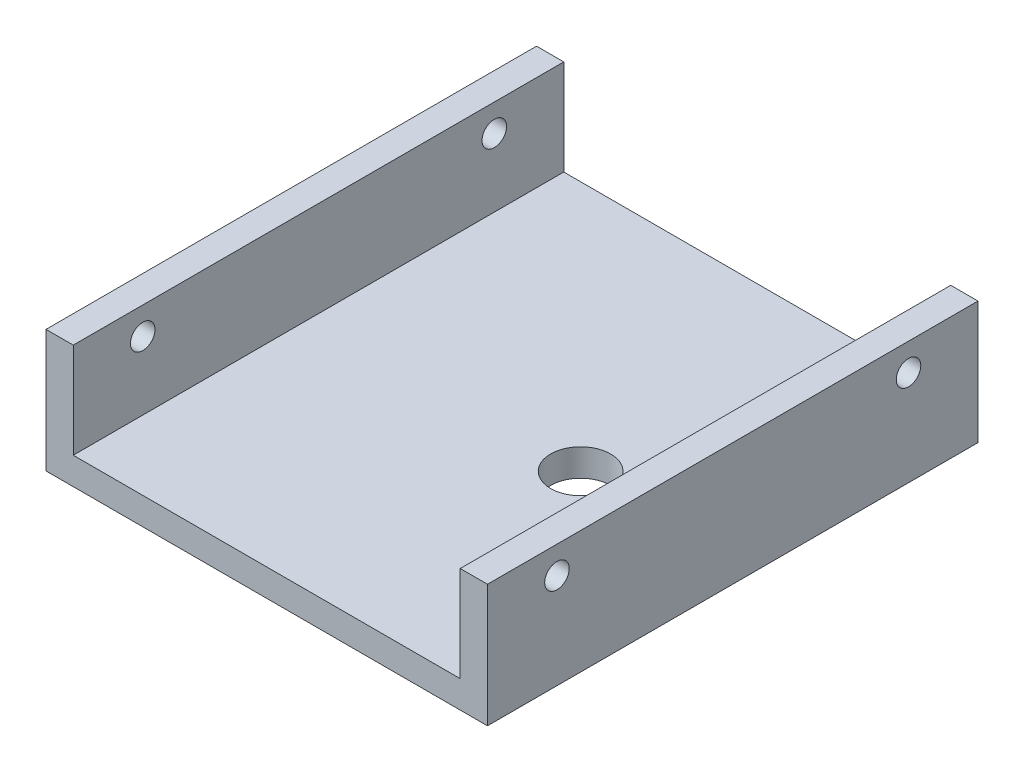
from build123d import *

# Parameters (mm, degrees)
EXTRUSION1_DEPTH           = 180
D_GAGEMENT_M81_D           = 9
R_P_TITION_LIN_AIRE1_COUNT = 2
R_P_TITION_LIN_AIRE1_PITCH = 129
D_GAGEMENT_M201_D          = 22


with BuildPart() as part:
    # Esquisse1 → Extrusion1 (new body)
    with BuildSketch(Plane.XY):
        Polygon((0, 35), (0, 0), (142, 0), (142, 35), (152, 35), (152, -10), (-10, -10), (-10, 35), align=None)
    extrude(amount=EXTRUSION1_DEPTH)

    # D_gagement M81 (through all)
    with Locations(Plane(origin=(152, 0, 0), x_dir=(0, 0, -1), z_dir=(1, 0, 0))):
        with Locations((-154.5, 25)):
            d_gagement_m81 = Hole(D_GAGEMENT_M81_D / 2)

    # R_p_tition lin_aire1: D_gagement M81 ×2
    with Locations(*[(0, 0, -i * R_P_TITION_LIN_AIRE1_PITCH) for i in range(1, R_P_TITION_LIN_AIRE1_COUNT)]):
        add(d_gagement_m81, mode=Mode.SUBTRACT)

    # D_gagement M201 (through all)
    with Locations(Plane.XZ.offset(10)):
        with Locations((98.18, 92)):
            Hole(D_GAGEMENT_M201_D / 2)


solid = part.part
